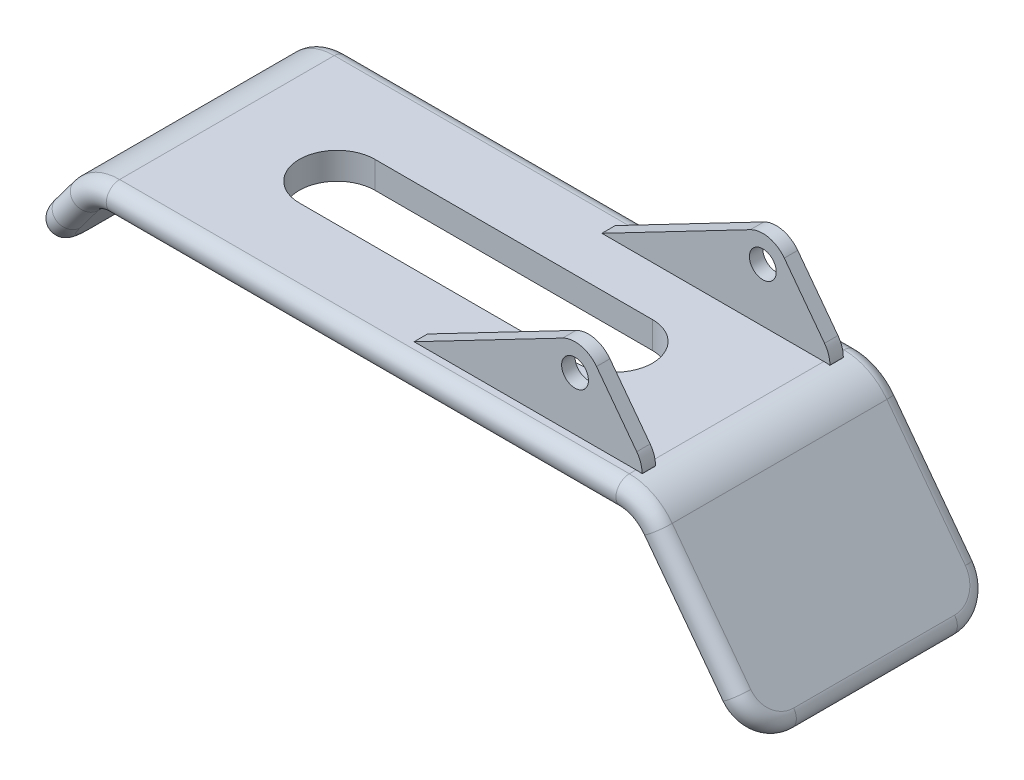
ISO-10303-21;
HEADER;
FILE_DESCRIPTION(('STEP AP214'),'2;1');
FILE_NAME('part.step','',(''),(''),'','','');
FILE_SCHEMA(('AUTOMOTIVE_DESIGN { 1 0 10303 214 1 1 1 1 }'));
ENDSEC;
DATA;
#1=APPLICATION_CONTEXT('core data for automotive mechanical design processes');
#2=APPLICATION_PROTOCOL_DEFINITION('international standard','automotive_design',2000,#1);
#3=PRODUCT_CONTEXT('',#1,'mechanical');
#4=PRODUCT('Part','Part','',(#3));
#5=PRODUCT_RELATED_PRODUCT_CATEGORY('part','',(#4));
#6=PRODUCT_DEFINITION_FORMATION('','',#4);
#7=PRODUCT_DEFINITION_CONTEXT('part definition',#1,'design');
#8=PRODUCT_DEFINITION('design','',#6,#7);
#9=PRODUCT_DEFINITION_SHAPE('','',#8);
#10=(LENGTH_UNIT() NAMED_UNIT(*) SI_UNIT(.MILLI.,.METRE.));
#11=(NAMED_UNIT(*) PLANE_ANGLE_UNIT() SI_UNIT($,.RADIAN.));
#12=(NAMED_UNIT(*) SI_UNIT($,.STERADIAN.) SOLID_ANGLE_UNIT());
#13=UNCERTAINTY_MEASURE_WITH_UNIT(LENGTH_MEASURE(1.E-05),#10,'distance_accuracy_value','');
#14=(GEOMETRIC_REPRESENTATION_CONTEXT(3) GLOBAL_UNCERTAINTY_ASSIGNED_CONTEXT((#13)) GLOBAL_UNIT_ASSIGNED_CONTEXT((#10,
#11,#12)) REPRESENTATION_CONTEXT('',''));
#15=CARTESIAN_POINT('',(0.,0.,0.));
#16=DIRECTION('',(0.,0.,1.));
#17=DIRECTION('',(1.,0.,0.));
#18=AXIS2_PLACEMENT_3D('',#15,#16,#17);
#19=CARTESIAN_POINT('',(19.,-2.,9.));
#20=DIRECTION('',(0.,0.,-1.));
#21=DIRECTION('',(-1.,0.,0.));
#22=AXIS2_PLACEMENT_3D('',#19,#20,#21);
#23=CYLINDRICAL_SURFACE('',#22,4.);
#24=CARTESIAN_POINT('',(19.,-2.,-6.5));
#25=DIRECTION('',(0.,0.,-1.));
#26=DIRECTION('',(1.,0.,0.));
#27=AXIS2_PLACEMENT_3D('',#24,#25,#26);
#28=CIRCLE('',#27,4.);
#29=CARTESIAN_POINT('',(19.,2.,-6.5));
#30=VERTEX_POINT('',#29);
#31=CARTESIAN_POINT('',(19.45,1.97460689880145,-6.5));
#32=VERTEX_POINT('',#31);
#33=EDGE_CURVE('E304',#30,#32,#28,.T.);
#34=ORIENTED_EDGE('',*,*,#33,.F.);
#35=DIRECTION('',(0.,0.,-1.));
#36=VECTOR('',#35,1.);
#37=CARTESIAN_POINT('',(19.,2.,9.));
#38=LINE('',#37,#36);
#39=CARTESIAN_POINT('',(19.,2.,6.5));
#40=VERTEX_POINT('',#39);
#41=EDGE_CURVE('E408',#40,#30,#38,.T.);
#42=ORIENTED_EDGE('',*,*,#41,.F.);
#43=CARTESIAN_POINT('',(19.,-2.,6.5));
#44=DIRECTION('',(0.,0.,-1.));
#45=DIRECTION('',(1.,0.,0.));
#46=AXIS2_PLACEMENT_3D('',#43,#44,#45);
#47=CIRCLE('',#46,4.);
#48=CARTESIAN_POINT('',(19.45,1.97460689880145,6.5));
#49=VERTEX_POINT('',#48);
#50=EDGE_CURVE('E347',#40,#49,#47,.T.);
#51=ORIENTED_EDGE('',*,*,#50,.T.);
#52=DIRECTION('',(0.,0.,1.));
#53=VECTOR('',#52,1.);
#54=CARTESIAN_POINT('',(19.45,1.97460689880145,6.5));
#55=LINE('',#54,#53);
#56=CARTESIAN_POINT('',(19.45,1.97460689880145,7.5));
#57=VERTEX_POINT('',#56);
#58=EDGE_CURVE('E366',#49,#57,#55,.T.);
#59=ORIENTED_EDGE('',*,*,#58,.T.);
#60=CARTESIAN_POINT('',(19.,-2.,7.5));
#61=DIRECTION('',(0.,0.,-1.));
#62=DIRECTION('',(1.,0.,0.));
#63=AXIS2_PLACEMENT_3D('',#60,#61,#62);
#64=CIRCLE('',#63,4.);
#65=CARTESIAN_POINT('',(19.,2.,7.5));
#66=VERTEX_POINT('',#65);
#67=EDGE_CURVE('E368',#66,#57,#64,.T.);
#68=ORIENTED_EDGE('',*,*,#67,.F.);
#69=CARTESIAN_POINT('',(19.,2.,8.));
#70=VERTEX_POINT('',#69);
#71=EDGE_CURVE('E404',#70,#66,#38,.T.);
#72=ORIENTED_EDGE('',*,*,#71,.F.);
#73=CARTESIAN_POINT('',(19.,-2.,8.));
#74=DIRECTION('',(0.,0.,1.));
#75=DIRECTION('',(1.,0.,0.));
#76=AXIS2_PLACEMENT_3D('',#73,#74,#75);
#77=CIRCLE('',#76,4.);
#78=CARTESIAN_POINT('',(22.2,0.400000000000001,8.));
#79=VERTEX_POINT('',#78);
#80=EDGE_CURVE('E426',#70,#79,#77,.F.);
#81=ORIENTED_EDGE('',*,*,#80,.T.);
#82=DIRECTION('',(0.,0.,-1.));
#83=VECTOR('',#82,1.);
#84=CARTESIAN_POINT('',(22.2,0.400000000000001,9.));
#85=LINE('',#84,#83);
#86=CARTESIAN_POINT('',(22.2,0.400000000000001,-8.));
#87=VERTEX_POINT('',#86);
#88=EDGE_CURVE('E407',#79,#87,#85,.T.);
#89=ORIENTED_EDGE('',*,*,#88,.T.);
#90=CARTESIAN_POINT('',(19.,-2.,-8.));
#91=DIRECTION('',(0.,0.,-1.));
#92=DIRECTION('',(-1.,0.,0.));
#93=AXIS2_PLACEMENT_3D('',#90,#91,#92);
#94=CIRCLE('',#93,4.);
#95=CARTESIAN_POINT('',(19.,2.,-8.));
#96=VERTEX_POINT('',#95);
#97=EDGE_CURVE('E423',#87,#96,#94,.F.);
#98=ORIENTED_EDGE('',*,*,#97,.T.);
#99=CARTESIAN_POINT('',(19.,2.,-7.5));
#100=VERTEX_POINT('',#99);
#101=EDGE_CURVE('E403',#100,#96,#38,.T.);
#102=ORIENTED_EDGE('',*,*,#101,.F.);
#103=CARTESIAN_POINT('',(19.,-2.,-7.5));
#104=DIRECTION('',(0.,0.,-1.));
#105=DIRECTION('',(1.,0.,0.));
#106=AXIS2_PLACEMENT_3D('',#103,#104,#105);
#107=CIRCLE('',#106,4.);
#108=CARTESIAN_POINT('',(19.45,1.97460689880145,-7.5));
#109=VERTEX_POINT('',#108);
#110=EDGE_CURVE('E293',#100,#109,#107,.T.);
#111=ORIENTED_EDGE('',*,*,#110,.T.);
#112=DIRECTION('',(0.,0.,-1.));
#113=VECTOR('',#112,1.);
#114=CARTESIAN_POINT('',(19.45,1.97460689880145,-6.5));
#115=LINE('',#114,#113);
#116=EDGE_CURVE('E321',#32,#109,#115,.T.);
#117=ORIENTED_EDGE('',*,*,#116,.F.);
#118=EDGE_LOOP('',(#34,#42,#51,#59,#68,#72,#81,#89,#98,#102,#111,#117));
#119=FACE_BOUND('',#118,.T.);
#120=ADVANCED_FACE('F34',(#119),#23,.T.);
#121=CARTESIAN_POINT('',(-19.,2.,9.));
#122=DIRECTION('',(0.,-1.,0.));
#123=DIRECTION('',(1.,0.,0.));
#124=AXIS2_PLACEMENT_3D('',#121,#122,#123);
#125=PLANE('',#124);
#126=DIRECTION('',(1.,0.,0.));
#127=VECTOR('',#126,1.);
#128=CARTESIAN_POINT('',(-10.785903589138,2.,2.81744789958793));
#129=LINE('',#128,#127);
#130=CARTESIAN_POINT('',(-10.785903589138,2.,2.81744789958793));
#131=VERTEX_POINT('',#130);
#132=CARTESIAN_POINT('',(9.90304434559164,2.,2.81744789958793));
#133=VERTEX_POINT('',#132);
#134=EDGE_CURVE('E266',#131,#133,#129,.T.);
#135=ORIENTED_EDGE('',*,*,#134,.F.);
#136=CARTESIAN_POINT('',(-10.785903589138,2.,0.));
#137=DIRECTION('',(0.,1.,0.));
#138=DIRECTION('',(-1.,0.,0.));
#139=AXIS2_PLACEMENT_3D('',#136,#137,#138);
#140=CIRCLE('',#139,2.81744789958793);
#141=CARTESIAN_POINT('',(-10.785903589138,2.,-2.81744789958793));
#142=VERTEX_POINT('',#141);
#143=EDGE_CURVE('E49',#142,#131,#140,.T.);
#144=ORIENTED_EDGE('',*,*,#143,.F.);
#145=DIRECTION('',(-1.,0.,0.));
#146=VECTOR('',#145,1.);
#147=CARTESIAN_POINT('',(-10.785903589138,2.,-2.81744789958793));
#148=LINE('',#147,#146);
#149=CARTESIAN_POINT('',(9.90304434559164,2.,-2.81744789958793));
#150=VERTEX_POINT('',#149);
#151=EDGE_CURVE('E273',#150,#142,#148,.T.);
#152=ORIENTED_EDGE('',*,*,#151,.F.);
#153=CARTESIAN_POINT('',(9.90304434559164,2.,0.));
#154=DIRECTION('',(0.,1.,0.));
#155=DIRECTION('',(-1.,0.,0.));
#156=AXIS2_PLACEMENT_3D('',#153,#154,#155);
#157=CIRCLE('',#156,2.81744789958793);
#158=EDGE_CURVE('E257',#133,#150,#157,.T.);
#159=ORIENTED_EDGE('',*,*,#158,.F.);
#160=EDGE_LOOP('',(#135,#144,#152,#159));
#161=FACE_BOUND('',#160,.T.);
#162=DIRECTION('',(1.,0.,0.));
#163=VECTOR('',#162,1.);
#164=CARTESIAN_POINT('',(2.45,2.,-6.5));
#165=LINE('',#164,#163);
#166=CARTESIAN_POINT('',(2.45,2.,-6.5));
#167=VERTEX_POINT('',#166);
#168=EDGE_CURVE('E289',#167,#30,#165,.T.);
#169=ORIENTED_EDGE('',*,*,#168,.F.);
#170=DIRECTION('',(0.,0.,-1.));
#171=VECTOR('',#170,1.);
#172=CARTESIAN_POINT('',(2.45,2.,-6.5));
#173=LINE('',#172,#171);
#174=CARTESIAN_POINT('',(2.45,2.,-7.5));
#175=VERTEX_POINT('',#174);
#176=EDGE_CURVE('E307',#167,#175,#173,.T.);
#177=ORIENTED_EDGE('',*,*,#176,.T.);
#178=DIRECTION('',(1.,0.,0.));
#179=VECTOR('',#178,1.);
#180=CARTESIAN_POINT('',(2.45,2.,-7.5));
#181=LINE('',#180,#179);
#182=EDGE_CURVE('E286',#175,#100,#181,.T.);
#183=ORIENTED_EDGE('',*,*,#182,.T.);
#184=ORIENTED_EDGE('',*,*,#101,.T.);
#185=DIRECTION('',(1.,0.,0.));
#186=VECTOR('',#185,1.);
#187=CARTESIAN_POINT('',(-19.,2.,-8.));
#188=LINE('',#187,#186);
#189=CARTESIAN_POINT('',(-19.,2.,-8.));
#190=VERTEX_POINT('',#189);
#191=EDGE_CURVE('E468',#96,#190,#188,.F.);
#192=ORIENTED_EDGE('',*,*,#191,.T.);
#193=DIRECTION('',(0.,0.,-1.));
#194=VECTOR('',#193,1.);
#195=CARTESIAN_POINT('',(-19.,2.,9.));
#196=LINE('',#195,#194);
#197=CARTESIAN_POINT('',(-19.,2.,8.));
#198=VERTEX_POINT('',#197);
#199=EDGE_CURVE('E400',#198,#190,#196,.T.);
#200=ORIENTED_EDGE('',*,*,#199,.F.);
#201=DIRECTION('',(1.,0.,0.));
#202=VECTOR('',#201,1.);
#203=CARTESIAN_POINT('',(-19.,2.,8.));
#204=LINE('',#203,#202);
#205=EDGE_CURVE('E465',#198,#70,#204,.T.);
#206=ORIENTED_EDGE('',*,*,#205,.T.);
#207=ORIENTED_EDGE('',*,*,#71,.T.);
#208=DIRECTION('',(1.,0.,0.));
#209=VECTOR('',#208,1.);
#210=CARTESIAN_POINT('',(2.45,2.,7.5));
#211=LINE('',#210,#209);
#212=CARTESIAN_POINT('',(2.45,2.,7.5));
#213=VERTEX_POINT('',#212);
#214=EDGE_CURVE('E341',#213,#66,#211,.T.);
#215=ORIENTED_EDGE('',*,*,#214,.F.);
#216=DIRECTION('',(0.,0.,1.));
#217=VECTOR('',#216,1.);
#218=CARTESIAN_POINT('',(2.45,2.,6.5));
#219=LINE('',#218,#217);
#220=CARTESIAN_POINT('',(2.45,2.,6.5));
#221=VERTEX_POINT('',#220);
#222=EDGE_CURVE('E384',#221,#213,#219,.T.);
#223=ORIENTED_EDGE('',*,*,#222,.F.);
#224=DIRECTION('',(1.,0.,0.));
#225=VECTOR('',#224,1.);
#226=CARTESIAN_POINT('',(2.45,2.,6.5));
#227=LINE('',#226,#225);
#228=EDGE_CURVE('E344',#221,#40,#227,.T.);
#229=ORIENTED_EDGE('',*,*,#228,.T.);
#230=ORIENTED_EDGE('',*,*,#41,.T.);
#231=EDGE_LOOP('',(#169,#177,#183,#184,#192,#200,#206,#207,#215,#223,#229,#230));
#232=FACE_BOUND('',#231,.T.);
#233=ADVANCED_FACE('F270',(#161,#232),#125,.F.);
#234=CARTESIAN_POINT('',(-19.,1.,8.));
#235=DIRECTION('',(-1.,0.,0.));
#236=DIRECTION('',(0.,-1.,0.));
#237=AXIS2_PLACEMENT_3D('',#234,#235,#236);
#238=CYLINDRICAL_SURFACE('',#237,1.);
#239=CARTESIAN_POINT('',(19.,1.,8.));
#240=DIRECTION('',(1.,0.,0.));
#241=DIRECTION('',(0.,0.,-1.));
#242=AXIS2_PLACEMENT_3D('',#239,#240,#241);
#243=CIRCLE('',#242,0.999999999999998);
#244=CARTESIAN_POINT('',(19.,0.,8.));
#245=VERTEX_POINT('',#244);
#246=EDGE_CURVE('E549',#70,#245,#243,.T.);
#247=ORIENTED_EDGE('',*,*,#246,.F.);
#248=ORIENTED_EDGE('',*,*,#205,.F.);
#249=CARTESIAN_POINT('',(-19.,1.,8.));
#250=DIRECTION('',(1.,0.,0.));
#251=DIRECTION('',(0.,0.,-1.));
#252=AXIS2_PLACEMENT_3D('',#249,#250,#251);
#253=CIRCLE('',#252,1.);
#254=CARTESIAN_POINT('',(-19.,0.,8.));
#255=VERTEX_POINT('',#254);
#256=EDGE_CURVE('E547',#198,#255,#253,.T.);
#257=ORIENTED_EDGE('',*,*,#256,.T.);
#258=DIRECTION('',(-1.,0.,0.));
#259=VECTOR('',#258,1.);
#260=CARTESIAN_POINT('',(-19.,0.,8.));
#261=LINE('',#260,#259);
#262=EDGE_CURVE('E471',#245,#255,#261,.T.);
#263=ORIENTED_EDGE('',*,*,#262,.F.);
#264=EDGE_LOOP('',(#247,#248,#257,#263));
#265=FACE_BOUND('',#264,.T.);
#266=ADVANCED_FACE('F36',(#265),#238,.T.);
#267=CARTESIAN_POINT('',(-19.,-2.,8.));
#268=DIRECTION('',(0.,0.,1.));
#269=DIRECTION('',(1.,0.,0.));
#270=AXIS2_PLACEMENT_3D('',#267,#268,#269);
#271=TOROIDAL_SURFACE('',#270,3.,1.);
#272=ORIENTED_EDGE('',*,*,#256,.F.);
#273=CARTESIAN_POINT('',(-19.,-2.,8.));
#274=DIRECTION('',(0.,0.,1.));
#275=DIRECTION('',(1.,0.,0.));
#276=AXIS2_PLACEMENT_3D('',#273,#274,#275);
#277=CIRCLE('',#276,4.);
#278=CARTESIAN_POINT('',(-22.2,0.399999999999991,8.));
#279=VERTEX_POINT('',#278);
#280=EDGE_CURVE('E477',#279,#198,#277,.F.);
#281=ORIENTED_EDGE('',*,*,#280,.F.);
#282=CARTESIAN_POINT('',(-21.4,-0.200000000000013,8.));
#283=DIRECTION('',(0.600000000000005,0.799999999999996,0.));
#284=DIRECTION('',(-0.799999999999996,0.600000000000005,0.));
#285=AXIS2_PLACEMENT_3D('',#282,#283,#284);
#286=CIRCLE('',#285,1.);
#287=CARTESIAN_POINT('',(-20.6,-0.800000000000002,8.));
#288=VERTEX_POINT('',#287);
#289=EDGE_CURVE('E545',#279,#288,#286,.T.);
#290=ORIENTED_EDGE('',*,*,#289,.T.);
#291=CARTESIAN_POINT('',(-19.,-2.,8.));
#292=DIRECTION('',(0.,0.,1.));
#293=DIRECTION('',(1.,0.,0.));
#294=AXIS2_PLACEMENT_3D('',#291,#292,#293);
#295=CIRCLE('',#294,2.);
#296=EDGE_CURVE('E483',#255,#288,#295,.T.);
#297=ORIENTED_EDGE('',*,*,#296,.F.);
#298=EDGE_LOOP('',(#272,#281,#290,#297));
#299=FACE_BOUND('',#298,.T.);
#300=ADVANCED_FACE('F664',(#299),#271,.T.);
#301=CARTESIAN_POINT('',(-22.75,-2.,8.));
#302=DIRECTION('',(-0.599999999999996,-0.800000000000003,0.));
#303=DIRECTION('',(0.800000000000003,-0.599999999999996,0.));
#304=AXIS2_PLACEMENT_3D('',#301,#302,#303);
#305=CYLINDRICAL_SURFACE('',#304,1.);
#306=ORIENTED_EDGE('',*,*,#289,.F.);
#307=DIRECTION('',(0.599999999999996,0.800000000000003,0.));
#308=VECTOR('',#307,1.);
#309=CARTESIAN_POINT('',(-23.55,-1.4,8.));
#310=LINE('',#309,#308);
#311=CARTESIAN_POINT('',(-23.55,-1.4,8.));
#312=VERTEX_POINT('',#311);
#313=EDGE_CURVE('E489',#312,#279,#310,.T.);
#314=ORIENTED_EDGE('',*,*,#313,.F.);
#315=CARTESIAN_POINT('',(-22.75,-2.,8.));
#316=DIRECTION('',(0.599999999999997,0.800000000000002,0.));
#317=DIRECTION('',(-0.800000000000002,0.599999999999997,0.));
#318=AXIS2_PLACEMENT_3D('',#315,#316,#317);
#319=CIRCLE('',#318,1.);
#320=CARTESIAN_POINT('',(-21.95,-2.59999999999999,8.));
#321=VERTEX_POINT('',#320);
#322=EDGE_CURVE('E543',#312,#321,#319,.T.);
#323=ORIENTED_EDGE('',*,*,#322,.T.);
#324=DIRECTION('',(-0.599999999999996,-0.800000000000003,0.));
#325=VECTOR('',#324,1.);
#326=CARTESIAN_POINT('',(-20.6,-0.800000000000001,8.));
#327=LINE('',#326,#325);
#328=EDGE_CURVE('E504',#288,#321,#327,.T.);
#329=ORIENTED_EDGE('',*,*,#328,.F.);
#330=EDGE_LOOP('',(#306,#314,#323,#329));
#331=FACE_BOUND('',#330,.T.);
#332=ADVANCED_FACE('F661',(#331),#305,.T.);
#333=CARTESIAN_POINT('',(-22.75,-2.,6.));
#334=DIRECTION('',(0.800000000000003,-0.599999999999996,0.));
#335=DIRECTION('',(0.599999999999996,0.800000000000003,0.));
#336=AXIS2_PLACEMENT_3D('',#333,#334,#335);
#337=TOROIDAL_SURFACE('',#336,2.,0.999999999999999);
#338=ORIENTED_EDGE('',*,*,#322,.F.);
#339=CARTESIAN_POINT('',(-23.55,-1.4,6.));
#340=DIRECTION('',(0.800000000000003,-0.599999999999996,0.));
#341=DIRECTION('',(0.599999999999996,0.800000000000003,0.));
#342=AXIS2_PLACEMENT_3D('',#339,#340,#341);
#343=CIRCLE('',#342,2.);
#344=CARTESIAN_POINT('',(-24.75,-3.00000000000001,6.));
#345=VERTEX_POINT('',#344);
#346=EDGE_CURVE('E492',#345,#312,#343,.F.);
#347=ORIENTED_EDGE('',*,*,#346,.F.);
#348=CARTESIAN_POINT('',(-23.95,-3.6,6.));
#349=DIRECTION('',(0.,0.,1.));
#350=DIRECTION('',(1.,0.,0.));
#351=AXIS2_PLACEMENT_3D('',#348,#349,#350);
#352=CIRCLE('',#351,0.999999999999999);
#353=CARTESIAN_POINT('',(-23.15,-4.2,6.));
#354=VERTEX_POINT('',#353);
#355=EDGE_CURVE('E541',#345,#354,#352,.T.);
#356=ORIENTED_EDGE('',*,*,#355,.T.);
#357=CARTESIAN_POINT('',(-21.95,-2.59999999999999,6.));
#358=DIRECTION('',(0.800000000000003,-0.599999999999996,0.));
#359=DIRECTION('',(0.599999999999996,0.800000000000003,0.));
#360=AXIS2_PLACEMENT_3D('',#357,#358,#359);
#361=CIRCLE('',#360,2.);
#362=EDGE_CURVE('E507',#321,#354,#361,.T.);
#363=ORIENTED_EDGE('',*,*,#362,.F.);
#364=EDGE_LOOP('',(#338,#347,#356,#363));
#365=FACE_BOUND('',#364,.T.);
#366=ADVANCED_FACE('F657',(#365),#337,.T.);
#367=CARTESIAN_POINT('',(-23.95,-3.6,-6.));
#368=DIRECTION('',(0.,0.,-1.));
#369=DIRECTION('',(-1.,0.,0.));
#370=AXIS2_PLACEMENT_3D('',#367,#368,#369);
#371=CYLINDRICAL_SURFACE('',#370,0.999999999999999);
#372=ORIENTED_EDGE('',*,*,#355,.F.);
#373=DIRECTION('',(0.,0.,1.));
#374=VECTOR('',#373,1.);
#375=CARTESIAN_POINT('',(-24.75,-3.,-6.));
#376=LINE('',#375,#374);
#377=CARTESIAN_POINT('',(-24.75,-3.00000000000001,-6.));
#378=VERTEX_POINT('',#377);
#379=EDGE_CURVE('E495',#378,#345,#376,.T.);
#380=ORIENTED_EDGE('',*,*,#379,.F.);
#381=CARTESIAN_POINT('',(-23.95,-3.6,-6.));
#382=DIRECTION('',(0.,0.,1.));
#383=DIRECTION('',(1.,0.,0.));
#384=AXIS2_PLACEMENT_3D('',#381,#382,#383);
#385=CIRCLE('',#384,0.999999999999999);
#386=CARTESIAN_POINT('',(-23.15,-4.2,-6.));
#387=VERTEX_POINT('',#386);
#388=EDGE_CURVE('E539',#378,#387,#385,.T.);
#389=ORIENTED_EDGE('',*,*,#388,.T.);
#390=DIRECTION('',(0.,0.,-1.));
#391=VECTOR('',#390,1.);
#392=CARTESIAN_POINT('',(-23.15,-4.2,9.));
#393=LINE('',#392,#391);
#394=EDGE_CURVE('E510',#354,#387,#393,.T.);
#395=ORIENTED_EDGE('',*,*,#394,.F.);
#396=EDGE_LOOP('',(#372,#380,#389,#395));
#397=FACE_BOUND('',#396,.T.);
#398=ADVANCED_FACE('F653',(#397),#371,.T.);
#399=CARTESIAN_POINT('',(-22.75,-1.99999999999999,-6.));
#400=DIRECTION('',(0.800000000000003,-0.599999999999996,0.));
#401=DIRECTION('',(0.599999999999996,0.800000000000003,0.));
#402=AXIS2_PLACEMENT_3D('',#399,#400,#401);
#403=TOROIDAL_SURFACE('',#402,2.,0.999999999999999);
#404=ORIENTED_EDGE('',*,*,#388,.F.);
#405=CARTESIAN_POINT('',(-23.55,-1.4,-6.));
#406=DIRECTION('',(0.800000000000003,-0.599999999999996,0.));
#407=DIRECTION('',(0.599999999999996,0.800000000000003,0.));
#408=AXIS2_PLACEMENT_3D('',#405,#406,#407);
#409=CIRCLE('',#408,2.);
#410=CARTESIAN_POINT('',(-23.55,-1.39999999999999,-8.));
#411=VERTEX_POINT('',#410);
#412=EDGE_CURVE('E498',#411,#378,#409,.F.);
#413=ORIENTED_EDGE('',*,*,#412,.F.);
#414=CARTESIAN_POINT('',(-22.75,-1.99999999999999,-8.));
#415=DIRECTION('',(-0.600000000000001,-0.799999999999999,0.));
#416=DIRECTION('',(0.799999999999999,-0.600000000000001,0.));
#417=AXIS2_PLACEMENT_3D('',#414,#415,#416);
#418=CIRCLE('',#417,0.999999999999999);
#419=CARTESIAN_POINT('',(-21.95,-2.6,-8.));
#420=VERTEX_POINT('',#419);
#421=EDGE_CURVE('E537',#411,#420,#418,.T.);
#422=ORIENTED_EDGE('',*,*,#421,.T.);
#423=CARTESIAN_POINT('',(-21.95,-2.59999999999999,-6.));
#424=DIRECTION('',(0.800000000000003,-0.599999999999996,0.));
#425=DIRECTION('',(0.599999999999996,0.800000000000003,0.));
#426=AXIS2_PLACEMENT_3D('',#423,#424,#425);
#427=CIRCLE('',#426,2.);
#428=EDGE_CURVE('E513',#387,#420,#427,.T.);
#429=ORIENTED_EDGE('',*,*,#428,.F.);
#430=EDGE_LOOP('',(#404,#413,#422,#429));
#431=FACE_BOUND('',#430,.T.);
#432=ADVANCED_FACE('F649',(#431),#403,.T.);
#433=CARTESIAN_POINT('',(-21.4,-0.200000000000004,-8.));
#434=DIRECTION('',(0.599999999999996,0.800000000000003,0.));
#435=DIRECTION('',(-0.800000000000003,0.599999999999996,0.));
#436=AXIS2_PLACEMENT_3D('',#433,#434,#435);
#437=CYLINDRICAL_SURFACE('',#436,1.);
#438=ORIENTED_EDGE('',*,*,#421,.F.);
#439=DIRECTION('',(0.599999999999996,0.800000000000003,0.));
#440=VECTOR('',#439,1.);
#441=CARTESIAN_POINT('',(-22.2,0.399999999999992,-8.));
#442=LINE('',#441,#440);
#443=CARTESIAN_POINT('',(-22.2,0.399999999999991,-8.));
#444=VERTEX_POINT('',#443);
#445=EDGE_CURVE('E501',#444,#411,#442,.F.);
#446=ORIENTED_EDGE('',*,*,#445,.F.);
#447=CARTESIAN_POINT('',(-21.4,-0.200000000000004,-8.));
#448=DIRECTION('',(-0.599999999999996,-0.800000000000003,0.));
#449=DIRECTION('',(0.800000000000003,-0.599999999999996,0.));
#450=AXIS2_PLACEMENT_3D('',#447,#448,#449);
#451=CIRCLE('',#450,1.);
#452=CARTESIAN_POINT('',(-20.6,-0.800000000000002,-8.));
#453=VERTEX_POINT('',#452);
#454=EDGE_CURVE('E535',#444,#453,#451,.T.);
#455=ORIENTED_EDGE('',*,*,#454,.T.);
#456=DIRECTION('',(-0.599999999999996,-0.800000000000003,0.));
#457=VECTOR('',#456,1.);
#458=CARTESIAN_POINT('',(-20.6,-0.8,-8.));
#459=LINE('',#458,#457);
#460=EDGE_CURVE('E516',#420,#453,#459,.F.);
#461=ORIENTED_EDGE('',*,*,#460,.F.);
#462=EDGE_LOOP('',(#438,#446,#455,#461));
#463=FACE_BOUND('',#462,.T.);
#464=ADVANCED_FACE('F645',(#463),#437,.T.);
#465=CARTESIAN_POINT('',(-19.,-2.,-8.));
#466=DIRECTION('',(0.,0.,-1.));
#467=DIRECTION('',(-1.,0.,0.));
#468=AXIS2_PLACEMENT_3D('',#465,#466,#467);
#469=TOROIDAL_SURFACE('',#468,3.,1.);
#470=ORIENTED_EDGE('',*,*,#454,.F.);
#471=CARTESIAN_POINT('',(-19.,-2.,-8.));
#472=DIRECTION('',(0.,0.,-1.));
#473=DIRECTION('',(-1.,0.,0.));
#474=AXIS2_PLACEMENT_3D('',#471,#472,#473);
#475=CIRCLE('',#474,4.);
#476=EDGE_CURVE('E480',#190,#444,#475,.F.);
#477=ORIENTED_EDGE('',*,*,#476,.F.);
#478=CARTESIAN_POINT('',(-19.,1.,-8.));
#479=DIRECTION('',(-1.,0.,0.));
#480=DIRECTION('',(0.,0.,1.));
#481=AXIS2_PLACEMENT_3D('',#478,#479,#480);
#482=CIRCLE('',#481,1.);
#483=CARTESIAN_POINT('',(-19.,0.,-8.));
#484=VERTEX_POINT('',#483);
#485=EDGE_CURVE('E533',#190,#484,#482,.T.);
#486=ORIENTED_EDGE('',*,*,#485,.T.);
#487=CARTESIAN_POINT('',(-19.,-2.,-8.));
#488=DIRECTION('',(0.,0.,-1.));
#489=DIRECTION('',(-1.,0.,0.));
#490=AXIS2_PLACEMENT_3D('',#487,#488,#489);
#491=CIRCLE('',#490,2.);
#492=EDGE_CURVE('E486',#453,#484,#491,.T.);
#493=ORIENTED_EDGE('',*,*,#492,.F.);
#494=EDGE_LOOP('',(#470,#477,#486,#493));
#495=FACE_BOUND('',#494,.T.);
#496=ADVANCED_FACE('F641',(#495),#469,.T.);
#497=CARTESIAN_POINT('',(19.,1.,-8.));
#498=DIRECTION('',(1.,0.,0.));
#499=DIRECTION('',(0.,1.,0.));
#500=AXIS2_PLACEMENT_3D('',#497,#498,#499);
#501=CYLINDRICAL_SURFACE('',#500,1.);
#502=ORIENTED_EDGE('',*,*,#485,.F.);
#503=ORIENTED_EDGE('',*,*,#191,.F.);
#504=CARTESIAN_POINT('',(19.,1.00000000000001,-8.));
#505=DIRECTION('',(-1.,0.,0.));
#506=DIRECTION('',(0.,0.,1.));
#507=AXIS2_PLACEMENT_3D('',#504,#505,#506);
#508=CIRCLE('',#507,0.999999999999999);
#509=CARTESIAN_POINT('',(19.,0.,-8.));
#510=VERTEX_POINT('',#509);
#511=EDGE_CURVE('E531',#96,#510,#508,.T.);
#512=ORIENTED_EDGE('',*,*,#511,.T.);
#513=DIRECTION('',(-1.,0.,0.));
#514=VECTOR('',#513,1.);
#515=CARTESIAN_POINT('',(19.,0.,-8.));
#516=LINE('',#515,#514);
#517=EDGE_CURVE('E474',#484,#510,#516,.F.);
#518=ORIENTED_EDGE('',*,*,#517,.F.);
#519=EDGE_LOOP('',(#502,#503,#512,#518));
#520=FACE_BOUND('',#519,.T.);
#521=ADVANCED_FACE('F637',(#520),#501,.T.);
#522=CARTESIAN_POINT('',(19.,-2.,-8.));
#523=DIRECTION('',(0.,0.,-1.));
#524=DIRECTION('',(-1.,0.,0.));
#525=AXIS2_PLACEMENT_3D('',#522,#523,#524);
#526=TOROIDAL_SURFACE('',#525,3.,1.);
#527=ORIENTED_EDGE('',*,*,#511,.F.);
#528=ORIENTED_EDGE('',*,*,#97,.F.);
#529=CARTESIAN_POINT('',(21.4,-0.199999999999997,-8.));
#530=DIRECTION('',(-0.599999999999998,0.800000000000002,0.));
#531=DIRECTION('',(-0.800000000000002,-0.599999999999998,0.));
#532=AXIS2_PLACEMENT_3D('',#529,#530,#531);
#533=CIRCLE('',#532,0.999999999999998);
#534=CARTESIAN_POINT('',(20.6,-0.799999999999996,-8.));
#535=VERTEX_POINT('',#534);
#536=EDGE_CURVE('E529',#87,#535,#533,.T.);
#537=ORIENTED_EDGE('',*,*,#536,.T.);
#538=CARTESIAN_POINT('',(19.,-2.,-8.));
#539=DIRECTION('',(0.,0.,-1.));
#540=DIRECTION('',(-1.,0.,0.));
#541=AXIS2_PLACEMENT_3D('',#538,#539,#540);
#542=CIRCLE('',#541,2.);
#543=EDGE_CURVE('E429',#510,#535,#542,.T.);
#544=ORIENTED_EDGE('',*,*,#543,.F.);
#545=EDGE_LOOP('',(#527,#528,#537,#544));
#546=FACE_BOUND('',#545,.T.);
#547=ADVANCED_FACE('F633',(#546),#526,.T.);
#548=CARTESIAN_POINT('',(27.25,-8.,-8.));
#549=DIRECTION('',(0.599999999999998,-0.800000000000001,0.));
#550=DIRECTION('',(0.800000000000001,0.599999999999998,0.));
#551=AXIS2_PLACEMENT_3D('',#548,#549,#550);
#552=CYLINDRICAL_SURFACE('',#551,1.);
#553=ORIENTED_EDGE('',*,*,#536,.F.);
#554=DIRECTION('',(0.599999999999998,-0.800000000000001,0.));
#555=VECTOR('',#554,1.);
#556=CARTESIAN_POINT('',(22.2,0.400000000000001,-8.));
#557=LINE('',#556,#555);
#558=CARTESIAN_POINT('',(28.05,-7.4,-8.));
#559=VERTEX_POINT('',#558);
#560=EDGE_CURVE('E435',#559,#87,#557,.F.);
#561=ORIENTED_EDGE('',*,*,#560,.F.);
#562=CARTESIAN_POINT('',(27.25,-8.,-8.));
#563=DIRECTION('',(-0.599999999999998,0.800000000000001,0.));
#564=DIRECTION('',(-0.800000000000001,-0.599999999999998,0.));
#565=AXIS2_PLACEMENT_3D('',#562,#563,#564);
#566=CIRCLE('',#565,1.);
#567=CARTESIAN_POINT('',(26.45,-8.6,-8.));
#568=VERTEX_POINT('',#567);
#569=EDGE_CURVE('E527',#559,#568,#566,.T.);
#570=ORIENTED_EDGE('',*,*,#569,.T.);
#571=DIRECTION('',(-0.599999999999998,0.800000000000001,0.));
#572=VECTOR('',#571,1.);
#573=CARTESIAN_POINT('',(26.45,-8.6,-8.));
#574=LINE('',#573,#572);
#575=EDGE_CURVE('E450',#535,#568,#574,.F.);
#576=ORIENTED_EDGE('',*,*,#575,.F.);
#577=EDGE_LOOP('',(#553,#561,#570,#576));
#578=FACE_BOUND('',#577,.T.);
#579=ADVANCED_FACE('F629',(#578),#552,.T.);
#580=CARTESIAN_POINT('',(27.25,-8.,-6.));
#581=DIRECTION('',(-0.800000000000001,-0.599999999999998,0.));
#582=DIRECTION('',(0.599999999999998,-0.800000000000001,0.));
#583=AXIS2_PLACEMENT_3D('',#580,#581,#582);
#584=TOROIDAL_SURFACE('',#583,2.,1.);
#585=ORIENTED_EDGE('',*,*,#569,.F.);
#586=CARTESIAN_POINT('',(28.05,-7.4,-6.));
#587=DIRECTION('',(-0.800000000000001,-0.599999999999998,0.));
#588=DIRECTION('',(0.599999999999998,-0.800000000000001,0.));
#589=AXIS2_PLACEMENT_3D('',#586,#587,#588);
#590=CIRCLE('',#589,2.);
#591=CARTESIAN_POINT('',(29.25,-9.,-6.));
#592=VERTEX_POINT('',#591);
#593=EDGE_CURVE('E438',#592,#559,#590,.F.);
#594=ORIENTED_EDGE('',*,*,#593,.F.);
#595=CARTESIAN_POINT('',(28.45,-9.6,-6.));
#596=DIRECTION('',(0.,0.,-1.));
#597=DIRECTION('',(-1.,0.,0.));
#598=AXIS2_PLACEMENT_3D('',#595,#596,#597);
#599=CIRCLE('',#598,1.);
#600=CARTESIAN_POINT('',(27.65,-10.2,-6.));
#601=VERTEX_POINT('',#600);
#602=EDGE_CURVE('E525',#592,#601,#599,.T.);
#603=ORIENTED_EDGE('',*,*,#602,.T.);
#604=CARTESIAN_POINT('',(26.45,-8.6,-6.));
#605=DIRECTION('',(-0.800000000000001,-0.599999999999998,0.));
#606=DIRECTION('',(0.599999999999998,-0.800000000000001,0.));
#607=AXIS2_PLACEMENT_3D('',#604,#605,#606);
#608=CIRCLE('',#607,2.);
#609=EDGE_CURVE('E453',#568,#601,#608,.T.);
#610=ORIENTED_EDGE('',*,*,#609,.F.);
#611=EDGE_LOOP('',(#585,#594,#603,#610));
#612=FACE_BOUND('',#611,.T.);
#613=ADVANCED_FACE('F625',(#612),#584,.T.);
#614=CARTESIAN_POINT('',(28.45,-9.6,6.));
#615=DIRECTION('',(0.,0.,1.));
#616=DIRECTION('',(1.,0.,0.));
#617=AXIS2_PLACEMENT_3D('',#614,#615,#616);
#618=CYLINDRICAL_SURFACE('',#617,1.);
#619=ORIENTED_EDGE('',*,*,#602,.F.);
#620=DIRECTION('',(0.,0.,-1.));
#621=VECTOR('',#620,1.);
#622=CARTESIAN_POINT('',(29.25,-9.,6.));
#623=LINE('',#622,#621);
#624=CARTESIAN_POINT('',(29.25,-9.,6.));
#625=VERTEX_POINT('',#624);
#626=EDGE_CURVE('E441',#625,#592,#623,.T.);
#627=ORIENTED_EDGE('',*,*,#626,.F.);
#628=CARTESIAN_POINT('',(28.45,-9.6,6.));
#629=DIRECTION('',(0.,0.,-1.));
#630=DIRECTION('',(-1.,0.,0.));
#631=AXIS2_PLACEMENT_3D('',#628,#629,#630);
#632=CIRCLE('',#631,1.);
#633=CARTESIAN_POINT('',(27.65,-10.2,6.));
#634=VERTEX_POINT('',#633);
#635=EDGE_CURVE('E523',#625,#634,#632,.T.);
#636=ORIENTED_EDGE('',*,*,#635,.T.);
#637=DIRECTION('',(0.,0.,1.));
#638=VECTOR('',#637,1.);
#639=CARTESIAN_POINT('',(27.65,-10.2,9.));
#640=LINE('',#639,#638);
#641=EDGE_CURVE('E456',#601,#634,#640,.T.);
#642=ORIENTED_EDGE('',*,*,#641,.F.);
#643=EDGE_LOOP('',(#619,#627,#636,#642));
#644=FACE_BOUND('',#643,.T.);
#645=ADVANCED_FACE('F621',(#644),#618,.T.);
#646=CARTESIAN_POINT('',(27.25,-8.,6.));
#647=DIRECTION('',(-0.800000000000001,-0.599999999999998,0.));
#648=DIRECTION('',(0.599999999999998,-0.800000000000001,0.));
#649=AXIS2_PLACEMENT_3D('',#646,#647,#648);
#650=TOROIDAL_SURFACE('',#649,2.,1.);
#651=ORIENTED_EDGE('',*,*,#635,.F.);
#652=CARTESIAN_POINT('',(28.05,-7.4,6.));
#653=DIRECTION('',(-0.800000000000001,-0.599999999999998,0.));
#654=DIRECTION('',(0.599999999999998,-0.800000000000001,0.));
#655=AXIS2_PLACEMENT_3D('',#652,#653,#654);
#656=CIRCLE('',#655,2.);
#657=CARTESIAN_POINT('',(28.05,-7.4,7.99999999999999));
#658=VERTEX_POINT('',#657);
#659=EDGE_CURVE('E444',#658,#625,#656,.F.);
#660=ORIENTED_EDGE('',*,*,#659,.F.);
#661=CARTESIAN_POINT('',(27.25,-8.,8.));
#662=DIRECTION('',(0.600000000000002,-0.799999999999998,0.));
#663=DIRECTION('',(0.799999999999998,0.600000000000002,0.));
#664=AXIS2_PLACEMENT_3D('',#661,#662,#663);
#665=CIRCLE('',#664,0.999999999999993);
#666=CARTESIAN_POINT('',(26.45,-8.59999999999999,8.00000000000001));
#667=VERTEX_POINT('',#666);
#668=EDGE_CURVE('E521',#658,#667,#665,.T.);
#669=ORIENTED_EDGE('',*,*,#668,.T.);
#670=CARTESIAN_POINT('',(26.45,-8.6,6.));
#671=DIRECTION('',(-0.800000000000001,-0.599999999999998,0.));
#672=DIRECTION('',(0.599999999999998,-0.800000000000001,0.));
#673=AXIS2_PLACEMENT_3D('',#670,#671,#672);
#674=CIRCLE('',#673,2.);
#675=EDGE_CURVE('E459',#634,#667,#674,.T.);
#676=ORIENTED_EDGE('',*,*,#675,.F.);
#677=EDGE_LOOP('',(#651,#660,#669,#676));
#678=FACE_BOUND('',#677,.T.);
#679=ADVANCED_FACE('F617',(#678),#650,.T.);
#680=CARTESIAN_POINT('',(21.4,-0.199999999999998,8.));
#681=DIRECTION('',(-0.599999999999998,0.800000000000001,0.));
#682=DIRECTION('',(-0.800000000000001,-0.599999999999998,0.));
#683=AXIS2_PLACEMENT_3D('',#680,#681,#682);
#684=CYLINDRICAL_SURFACE('',#683,0.999999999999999);
#685=ORIENTED_EDGE('',*,*,#668,.F.);
#686=DIRECTION('',(0.599999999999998,-0.800000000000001,0.));
#687=VECTOR('',#686,1.);
#688=CARTESIAN_POINT('',(22.2,0.400000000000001,8.));
#689=LINE('',#688,#687);
#690=EDGE_CURVE('E447',#79,#658,#689,.T.);
#691=ORIENTED_EDGE('',*,*,#690,.F.);
#692=CARTESIAN_POINT('',(21.4,-0.199999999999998,8.));
#693=DIRECTION('',(0.599999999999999,-0.800000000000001,0.));
#694=DIRECTION('',(0.800000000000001,0.599999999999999,0.));
#695=AXIS2_PLACEMENT_3D('',#692,#693,#694);
#696=CIRCLE('',#695,0.999999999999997);
#697=CARTESIAN_POINT('',(20.6,-0.799999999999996,8.));
#698=VERTEX_POINT('',#697);
#699=EDGE_CURVE('E519',#79,#698,#696,.T.);
#700=ORIENTED_EDGE('',*,*,#699,.T.);
#701=DIRECTION('',(-0.599999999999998,0.800000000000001,0.));
#702=VECTOR('',#701,1.);
#703=CARTESIAN_POINT('',(20.6,-0.799999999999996,8.));
#704=LINE('',#703,#702);
#705=EDGE_CURVE('E462',#667,#698,#704,.T.);
#706=ORIENTED_EDGE('',*,*,#705,.F.);
#707=EDGE_LOOP('',(#685,#691,#700,#706));
#708=FACE_BOUND('',#707,.T.);
#709=ADVANCED_FACE('F613',(#708),#684,.T.);
#710=CARTESIAN_POINT('',(19.,-2.,8.));
#711=DIRECTION('',(0.,0.,1.));
#712=DIRECTION('',(1.,0.,0.));
#713=AXIS2_PLACEMENT_3D('',#710,#711,#712);
#714=TOROIDAL_SURFACE('',#713,3.,0.999999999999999);
#715=ORIENTED_EDGE('',*,*,#80,.F.);
#716=ORIENTED_EDGE('',*,*,#246,.T.);
#717=CARTESIAN_POINT('',(19.,-2.,8.));
#718=DIRECTION('',(0.,0.,1.));
#719=DIRECTION('',(1.,0.,0.));
#720=AXIS2_PLACEMENT_3D('',#717,#718,#719);
#721=CIRCLE('',#720,2.);
#722=EDGE_CURVE('E432',#698,#245,#721,.T.);
#723=ORIENTED_EDGE('',*,*,#722,.F.);
#724=ORIENTED_EDGE('',*,*,#699,.F.);
#725=EDGE_LOOP('',(#715,#716,#723,#724));
#726=FACE_BOUND('',#725,.T.);
#727=ADVANCED_FACE('F609',(#726),#714,.T.);
#728=CARTESIAN_POINT('',(-22.2,0.399999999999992,9.));
#729=DIRECTION('',(0.800000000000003,-0.599999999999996,0.));
#730=DIRECTION('',(0.599999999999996,0.800000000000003,0.));
#731=AXIS2_PLACEMENT_3D('',#728,#729,#730);
#732=PLANE('',#731);
#733=DIRECTION('',(0.,0.,-1.));
#734=VECTOR('',#733,1.);
#735=CARTESIAN_POINT('',(-22.2,0.399999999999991,9.));
#736=LINE('',#735,#734);
#737=EDGE_CURVE('E387',#279,#444,#736,.T.);
#738=ORIENTED_EDGE('',*,*,#737,.T.);
#739=ORIENTED_EDGE('',*,*,#445,.T.);
#740=ORIENTED_EDGE('',*,*,#412,.T.);
#741=ORIENTED_EDGE('',*,*,#379,.T.);
#742=ORIENTED_EDGE('',*,*,#346,.T.);
#743=ORIENTED_EDGE('',*,*,#313,.T.);
#744=EDGE_LOOP('',(#738,#739,#740,#741,#742,#743));
#745=FACE_BOUND('',#744,.T.);
#746=ADVANCED_FACE('F605',(#745),#732,.F.);
#747=CARTESIAN_POINT('',(-20.6,-0.800000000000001,9.));
#748=DIRECTION('',(0.800000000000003,-0.599999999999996,0.));
#749=DIRECTION('',(0.599999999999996,0.800000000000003,0.));
#750=AXIS2_PLACEMENT_3D('',#747,#748,#749);
#751=PLANE('',#750);
#752=ORIENTED_EDGE('',*,*,#428,.T.);
#753=ORIENTED_EDGE('',*,*,#460,.T.);
#754=DIRECTION('',(0.,0.,-1.));
#755=VECTOR('',#754,1.);
#756=CARTESIAN_POINT('',(-20.6,-0.800000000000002,9.));
#757=LINE('',#756,#755);
#758=EDGE_CURVE('E420',#288,#453,#757,.T.);
#759=ORIENTED_EDGE('',*,*,#758,.F.);
#760=ORIENTED_EDGE('',*,*,#328,.T.);
#761=ORIENTED_EDGE('',*,*,#362,.T.);
#762=ORIENTED_EDGE('',*,*,#394,.T.);
#763=EDGE_LOOP('',(#752,#753,#759,#760,#761,#762));
#764=FACE_BOUND('',#763,.T.);
#765=ADVANCED_FACE('F601',(#764),#751,.T.);
#766=CARTESIAN_POINT('',(-19.,-2.,9.));
#767=DIRECTION('',(0.,0.,-1.));
#768=DIRECTION('',(-1.,0.,0.));
#769=AXIS2_PLACEMENT_3D('',#766,#767,#768);
#770=CYLINDRICAL_SURFACE('',#769,2.);
#771=ORIENTED_EDGE('',*,*,#758,.T.);
#772=ORIENTED_EDGE('',*,*,#492,.T.);
#773=DIRECTION('',(0.,0.,-1.));
#774=VECTOR('',#773,1.);
#775=CARTESIAN_POINT('',(-19.,0.,9.));
#776=LINE('',#775,#774);
#777=EDGE_CURVE('E417',#255,#484,#776,.T.);
#778=ORIENTED_EDGE('',*,*,#777,.F.);
#779=ORIENTED_EDGE('',*,*,#296,.T.);
#780=EDGE_LOOP('',(#771,#772,#778,#779));
#781=FACE_BOUND('',#780,.T.);
#782=ADVANCED_FACE('F598',(#781),#770,.F.);
#783=CARTESIAN_POINT('',(-19.,0.,9.));
#784=DIRECTION('',(0.,-1.,0.));
#785=DIRECTION('',(1.,0.,0.));
#786=AXIS2_PLACEMENT_3D('',#783,#784,#785);
#787=PLANE('',#786);
#788=CARTESIAN_POINT('',(-10.785903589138,0.,0.));
#789=DIRECTION('',(0.,-1.,0.));
#790=DIRECTION('',(1.,0.,0.));
#791=AXIS2_PLACEMENT_3D('',#788,#789,#790);
#792=CIRCLE('',#791,2.81744789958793);
#793=CARTESIAN_POINT('',(-10.785903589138,0.,2.81744789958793));
#794=VERTEX_POINT('',#793);
#795=CARTESIAN_POINT('',(-10.785903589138,0.,-2.81744789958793));
#796=VERTEX_POINT('',#795);
#797=EDGE_CURVE('E11',#794,#796,#792,.T.);
#798=ORIENTED_EDGE('',*,*,#797,.F.);
#799=DIRECTION('',(-1.,0.,0.));
#800=VECTOR('',#799,1.);
#801=CARTESIAN_POINT('',(-19.,0.,2.81744789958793));
#802=LINE('',#801,#800);
#803=CARTESIAN_POINT('',(9.90304434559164,0.,2.81744789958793));
#804=VERTEX_POINT('',#803);
#805=EDGE_CURVE('E551',#804,#794,#802,.T.);
#806=ORIENTED_EDGE('',*,*,#805,.F.);
#807=CARTESIAN_POINT('',(9.90304434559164,0.,0.));
#808=DIRECTION('',(0.,-1.,0.));
#809=DIRECTION('',(1.,0.,0.));
#810=AXIS2_PLACEMENT_3D('',#807,#808,#809);
#811=CIRCLE('',#810,2.81744789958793);
#812=CARTESIAN_POINT('',(9.90304434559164,0.,-2.81744789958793));
#813=VERTEX_POINT('',#812);
#814=EDGE_CURVE('E260',#813,#804,#811,.T.);
#815=ORIENTED_EDGE('',*,*,#814,.F.);
#816=DIRECTION('',(1.,0.,0.));
#817=VECTOR('',#816,1.);
#818=CARTESIAN_POINT('',(-19.,0.,-2.81744789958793));
#819=LINE('',#818,#817);
#820=EDGE_CURVE('E42',#796,#813,#819,.T.);
#821=ORIENTED_EDGE('',*,*,#820,.F.);
#822=EDGE_LOOP('',(#798,#806,#815,#821));
#823=FACE_BOUND('',#822,.T.);
#824=ORIENTED_EDGE('',*,*,#777,.T.);
#825=ORIENTED_EDGE('',*,*,#517,.T.);
#826=DIRECTION('',(0.,0.,-1.));
#827=VECTOR('',#826,1.);
#828=CARTESIAN_POINT('',(19.,0.,9.));
#829=LINE('',#828,#827);
#830=EDGE_CURVE('E414',#245,#510,#829,.T.);
#831=ORIENTED_EDGE('',*,*,#830,.F.);
#832=ORIENTED_EDGE('',*,*,#262,.T.);
#833=EDGE_LOOP('',(#824,#825,#831,#832));
#834=FACE_BOUND('',#833,.T.);
#835=ADVANCED_FACE('F559',(#823,#834),#787,.T.);
#836=CARTESIAN_POINT('',(19.,-2.,9.));
#837=DIRECTION('',(0.,0.,-1.));
#838=DIRECTION('',(-1.,0.,0.));
#839=AXIS2_PLACEMENT_3D('',#836,#837,#838);
#840=CYLINDRICAL_SURFACE('',#839,2.);
#841=DIRECTION('',(0.,0.,-1.));
#842=VECTOR('',#841,1.);
#843=CARTESIAN_POINT('',(20.6,-0.799999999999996,9.));
#844=LINE('',#843,#842);
#845=EDGE_CURVE('E411',#698,#535,#844,.T.);
#846=ORIENTED_EDGE('',*,*,#845,.F.);
#847=ORIENTED_EDGE('',*,*,#722,.T.);
#848=ORIENTED_EDGE('',*,*,#830,.T.);
#849=ORIENTED_EDGE('',*,*,#543,.T.);
#850=EDGE_LOOP('',(#846,#847,#848,#849));
#851=FACE_BOUND('',#850,.T.);
#852=ADVANCED_FACE('F591',(#851),#840,.F.);
#853=CARTESIAN_POINT('',(20.6,-0.799999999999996,9.));
#854=DIRECTION('',(-0.800000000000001,-0.599999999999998,0.));
#855=DIRECTION('',(0.599999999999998,-0.800000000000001,0.));
#856=AXIS2_PLACEMENT_3D('',#853,#854,#855);
#857=PLANE('',#856);
#858=ORIENTED_EDGE('',*,*,#675,.T.);
#859=ORIENTED_EDGE('',*,*,#705,.T.);
#860=ORIENTED_EDGE('',*,*,#845,.T.);
#861=ORIENTED_EDGE('',*,*,#575,.T.);
#862=ORIENTED_EDGE('',*,*,#609,.T.);
#863=ORIENTED_EDGE('',*,*,#641,.T.);
#864=EDGE_LOOP('',(#858,#859,#860,#861,#862,#863));
#865=FACE_BOUND('',#864,.T.);
#866=ADVANCED_FACE('F587',(#865),#857,.T.);
#867=CARTESIAN_POINT('',(22.2,0.400000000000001,9.));
#868=DIRECTION('',(-0.800000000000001,-0.599999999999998,0.));
#869=DIRECTION('',(0.599999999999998,-0.800000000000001,0.));
#870=AXIS2_PLACEMENT_3D('',#867,#868,#869);
#871=PLANE('',#870);
#872=ORIENTED_EDGE('',*,*,#88,.F.);
#873=ORIENTED_EDGE('',*,*,#690,.T.);
#874=ORIENTED_EDGE('',*,*,#659,.T.);
#875=ORIENTED_EDGE('',*,*,#626,.T.);
#876=ORIENTED_EDGE('',*,*,#593,.T.);
#877=ORIENTED_EDGE('',*,*,#560,.T.);
#878=EDGE_LOOP('',(#872,#873,#874,#875,#876,#877));
#879=FACE_BOUND('',#878,.T.);
#880=ADVANCED_FACE('F583',(#879),#871,.F.);
#881=CARTESIAN_POINT('',(-19.,-2.,9.));
#882=DIRECTION('',(0.,0.,-1.));
#883=DIRECTION('',(-1.,0.,0.));
#884=AXIS2_PLACEMENT_3D('',#881,#882,#883);
#885=CYLINDRICAL_SURFACE('',#884,4.);
#886=ORIENTED_EDGE('',*,*,#199,.T.);
#887=ORIENTED_EDGE('',*,*,#476,.T.);
#888=ORIENTED_EDGE('',*,*,#737,.F.);
#889=ORIENTED_EDGE('',*,*,#280,.T.);
#890=EDGE_LOOP('',(#886,#887,#888,#889));
#891=FACE_BOUND('',#890,.T.);
#892=ADVANCED_FACE('F586',(#891),#885,.T.);
#893=CARTESIAN_POINT('',(2.45,2.,6.5));
#894=DIRECTION('',(-0.46224989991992,0.88674969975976,0.));
#895=DIRECTION('',(-0.88674969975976,-0.46224989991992,0.));
#896=AXIS2_PLACEMENT_3D('',#893,#894,#895);
#897=PLANE('',#896);
#898=DIRECTION('',(-0.88674969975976,-0.46224989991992,0.));
#899=VECTOR('',#898,1.);
#900=CARTESIAN_POINT('',(2.45,2.,7.5));
#901=LINE('',#900,#899);
#902=CARTESIAN_POINT('',(13.5255002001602,7.77349939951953,7.5));
#903=VERTEX_POINT('',#902);
#904=EDGE_CURVE('E348',#903,#213,#901,.T.);
#905=ORIENTED_EDGE('',*,*,#904,.F.);
#906=DIRECTION('',(0.,0.,1.));
#907=VECTOR('',#906,1.);
#908=CARTESIAN_POINT('',(13.5255002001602,7.77349939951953,6.5));
#909=LINE('',#908,#907);
#910=CARTESIAN_POINT('',(13.5255002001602,7.77349939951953,6.5));
#911=VERTEX_POINT('',#910);
#912=EDGE_CURVE('E388',#911,#903,#909,.T.);
#913=ORIENTED_EDGE('',*,*,#912,.F.);
#914=DIRECTION('',(-0.88674969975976,-0.46224989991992,0.));
#915=VECTOR('',#914,1.);
#916=CARTESIAN_POINT('',(2.45,2.,6.5));
#917=LINE('',#916,#915);
#918=EDGE_CURVE('E363',#911,#221,#917,.T.);
#919=ORIENTED_EDGE('',*,*,#918,.T.);
#920=ORIENTED_EDGE('',*,*,#222,.T.);
#921=EDGE_LOOP('',(#905,#913,#919,#920));
#922=FACE_BOUND('',#921,.T.);
#923=ADVANCED_FACE('F716',(#922),#897,.T.);
#924=CARTESIAN_POINT('',(14.45,6.00000000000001,6.5));
#925=DIRECTION('',(0.,0.,1.));
#926=DIRECTION('',(1.,0.,0.));
#927=AXIS2_PLACEMENT_3D('',#924,#925,#926);
#928=CYLINDRICAL_SURFACE('',#927,2.);
#929=CARTESIAN_POINT('',(14.45,6.00000000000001,7.5));
#930=DIRECTION('',(0.,0.,1.));
#931=DIRECTION('',(-1.,0.,0.));
#932=AXIS2_PLACEMENT_3D('',#929,#930,#931);
#933=CIRCLE('',#932,2.);
#934=CARTESIAN_POINT('',(16.05,7.20000000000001,7.5));
#935=VERTEX_POINT('',#934);
#936=EDGE_CURVE('E380',#935,#903,#933,.T.);
#937=ORIENTED_EDGE('',*,*,#936,.F.);
#938=DIRECTION('',(0.,0.,1.));
#939=VECTOR('',#938,1.);
#940=CARTESIAN_POINT('',(16.05,7.20000000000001,6.5));
#941=LINE('',#940,#939);
#942=CARTESIAN_POINT('',(16.05,7.20000000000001,6.5));
#943=VERTEX_POINT('',#942);
#944=EDGE_CURVE('E390',#943,#935,#941,.T.);
#945=ORIENTED_EDGE('',*,*,#944,.F.);
#946=CARTESIAN_POINT('',(14.45,6.00000000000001,6.5));
#947=DIRECTION('',(0.,0.,1.));
#948=DIRECTION('',(-1.,0.,0.));
#949=AXIS2_PLACEMENT_3D('',#946,#947,#948);
#950=CIRCLE('',#949,2.);
#951=EDGE_CURVE('E360',#943,#911,#950,.T.);
#952=ORIENTED_EDGE('',*,*,#951,.T.);
#953=ORIENTED_EDGE('',*,*,#912,.T.);
#954=EDGE_LOOP('',(#937,#945,#952,#953));
#955=FACE_BOUND('',#954,.T.);
#956=ADVANCED_FACE('F788',(#955),#928,.T.);
#957=CARTESIAN_POINT('',(16.05,7.20000000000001,6.5));
#958=DIRECTION('',(0.800000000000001,0.599999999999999,0.));
#959=DIRECTION('',(-0.599999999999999,0.800000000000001,0.));
#960=AXIS2_PLACEMENT_3D('',#957,#958,#959);
#961=PLANE('',#960);
#962=DIRECTION('',(-0.599999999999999,0.800000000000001,0.));
#963=VECTOR('',#962,1.);
#964=CARTESIAN_POINT('',(16.05,7.20000000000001,7.5));
#965=LINE('',#964,#963);
#966=CARTESIAN_POINT('',(19.05,3.2,7.5));
#967=VERTEX_POINT('',#966);
#968=EDGE_CURVE('E377',#967,#935,#965,.T.);
#969=ORIENTED_EDGE('',*,*,#968,.F.);
#970=DIRECTION('',(0.,0.,1.));
#971=VECTOR('',#970,1.);
#972=CARTESIAN_POINT('',(19.05,3.2,6.5));
#973=LINE('',#972,#971);
#974=CARTESIAN_POINT('',(19.05,3.2,6.5));
#975=VERTEX_POINT('',#974);
#976=EDGE_CURVE('E392',#975,#967,#973,.T.);
#977=ORIENTED_EDGE('',*,*,#976,.F.);
#978=DIRECTION('',(-0.599999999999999,0.800000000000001,0.));
#979=VECTOR('',#978,1.);
#980=CARTESIAN_POINT('',(16.05,7.20000000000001,6.5));
#981=LINE('',#980,#979);
#982=EDGE_CURVE('E357',#975,#943,#981,.T.);
#983=ORIENTED_EDGE('',*,*,#982,.T.);
#984=ORIENTED_EDGE('',*,*,#944,.T.);
#985=EDGE_LOOP('',(#969,#977,#983,#984));
#986=FACE_BOUND('',#985,.T.);
#987=ADVANCED_FACE('F791',(#986),#961,.T.);
#988=CARTESIAN_POINT('',(17.45,2.,6.5));
#989=DIRECTION('',(0.,0.,1.));
#990=DIRECTION('',(1.,0.,0.));
#991=AXIS2_PLACEMENT_3D('',#988,#989,#990);
#992=CYLINDRICAL_SURFACE('',#991,2.);
#993=CARTESIAN_POINT('',(17.45,2.,7.5));
#994=DIRECTION('',(0.,0.,1.));
#995=DIRECTION('',(-1.,0.,0.));
#996=AXIS2_PLACEMENT_3D('',#993,#994,#995);
#997=CIRCLE('',#996,2.);
#998=CARTESIAN_POINT('',(19.45,2.,7.5));
#999=VERTEX_POINT('',#998);
#1000=EDGE_CURVE('E374',#999,#967,#997,.T.);
#1001=ORIENTED_EDGE('',*,*,#1000,.F.);
#1002=DIRECTION('',(0.,0.,1.));
#1003=VECTOR('',#1002,1.);
#1004=CARTESIAN_POINT('',(19.45,2.,6.5));
#1005=LINE('',#1004,#1003);
#1006=CARTESIAN_POINT('',(19.45,2.,6.5));
#1007=VERTEX_POINT('',#1006);
#1008=EDGE_CURVE('E394',#1007,#999,#1005,.T.);
#1009=ORIENTED_EDGE('',*,*,#1008,.F.);
#1010=CARTESIAN_POINT('',(17.45,2.,6.5));
#1011=DIRECTION('',(0.,0.,1.));
#1012=DIRECTION('',(-1.,0.,0.));
#1013=AXIS2_PLACEMENT_3D('',#1010,#1011,#1012);
#1014=CIRCLE('',#1013,2.);
#1015=EDGE_CURVE('E354',#1007,#975,#1014,.T.);
#1016=ORIENTED_EDGE('',*,*,#1015,.T.);
#1017=ORIENTED_EDGE('',*,*,#976,.T.);
#1018=EDGE_LOOP('',(#1001,#1009,#1016,#1017));
#1019=FACE_BOUND('',#1018,.T.);
#1020=ADVANCED_FACE('F795',(#1019),#992,.T.);
#1021=CARTESIAN_POINT('',(19.45,2.,6.5));
#1022=DIRECTION('',(1.,1.36629509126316E-13,0.));
#1023=DIRECTION('',(-1.36629509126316E-13,1.,0.));
#1024=AXIS2_PLACEMENT_3D('',#1021,#1022,#1023);
#1025=PLANE('',#1024);
#1026=DIRECTION('',(-1.36629509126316E-13,1.,0.));
#1027=VECTOR('',#1026,1.);
#1028=CARTESIAN_POINT('',(19.45,2.,7.5));
#1029=LINE('',#1028,#1027);
#1030=EDGE_CURVE('E371',#57,#999,#1029,.T.);
#1031=ORIENTED_EDGE('',*,*,#1030,.F.);
#1032=ORIENTED_EDGE('',*,*,#58,.F.);
#1033=DIRECTION('',(-1.36629509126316E-13,1.,0.));
#1034=VECTOR('',#1033,1.);
#1035=CARTESIAN_POINT('',(19.45,2.,6.5));
#1036=LINE('',#1035,#1034);
#1037=EDGE_CURVE('E351',#49,#1007,#1036,.T.);
#1038=ORIENTED_EDGE('',*,*,#1037,.T.);
#1039=ORIENTED_EDGE('',*,*,#1008,.T.);
#1040=EDGE_LOOP('',(#1031,#1032,#1038,#1039));
#1041=FACE_BOUND('',#1040,.T.);
#1042=ADVANCED_FACE('F781',(#1041),#1025,.T.);
#1043=CARTESIAN_POINT('',(19.,-2.,6.5));
#1044=DIRECTION('',(0.,0.,1.));
#1045=DIRECTION('',(1.,0.,0.));
#1046=AXIS2_PLACEMENT_3D('',#1043,#1044,#1045);
#1047=PLANE('',#1046);
#1048=CARTESIAN_POINT('',(14.45,6.00000000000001,6.5));
#1049=DIRECTION('',(0.,0.,1.));
#1050=DIRECTION('',(1.,0.,0.));
#1051=AXIS2_PLACEMENT_3D('',#1048,#1049,#1050);
#1052=CIRCLE('',#1051,1.);
#1053=CARTESIAN_POINT('',(15.45,6.00000000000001,6.5));
#1054=VERTEX_POINT('',#1053);
#1055=EDGE_CURVE('E338',#1054,#1054,#1052,.T.);
#1056=ORIENTED_EDGE('',*,*,#1055,.T.);
#1057=EDGE_LOOP('',(#1056));
#1058=FACE_BOUND('',#1057,.T.);
#1059=ORIENTED_EDGE('',*,*,#228,.F.);
#1060=ORIENTED_EDGE('',*,*,#918,.F.);
#1061=ORIENTED_EDGE('',*,*,#951,.F.);
#1062=ORIENTED_EDGE('',*,*,#982,.F.);
#1063=ORIENTED_EDGE('',*,*,#1015,.F.);
#1064=ORIENTED_EDGE('',*,*,#1037,.F.);
#1065=ORIENTED_EDGE('',*,*,#50,.F.);
#1066=EDGE_LOOP('',(#1059,#1060,#1061,#1062,#1063,#1064,#1065));
#1067=FACE_BOUND('',#1066,.T.);
#1068=ADVANCED_FACE('F720',(#1058,#1067),#1047,.F.);
#1069=CARTESIAN_POINT('',(19.,-2.,7.5));
#1070=DIRECTION('',(0.,0.,1.));
#1071=DIRECTION('',(1.,0.,0.));
#1072=AXIS2_PLACEMENT_3D('',#1069,#1070,#1071);
#1073=PLANE('',#1072);
#1074=CARTESIAN_POINT('',(14.45,6.00000000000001,7.5));
#1075=DIRECTION('',(0.,0.,1.));
#1076=DIRECTION('',(1.,0.,0.));
#1077=AXIS2_PLACEMENT_3D('',#1074,#1075,#1076);
#1078=CIRCLE('',#1077,1.);
#1079=CARTESIAN_POINT('',(15.45,6.00000000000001,7.5));
#1080=VERTEX_POINT('',#1079);
#1081=EDGE_CURVE('E324',#1080,#1080,#1078,.T.);
#1082=ORIENTED_EDGE('',*,*,#1081,.F.);
#1083=EDGE_LOOP('',(#1082));
#1084=FACE_BOUND('',#1083,.T.);
#1085=ORIENTED_EDGE('',*,*,#214,.T.);
#1086=ORIENTED_EDGE('',*,*,#67,.T.);
#1087=ORIENTED_EDGE('',*,*,#1030,.T.);
#1088=ORIENTED_EDGE('',*,*,#1000,.T.);
#1089=ORIENTED_EDGE('',*,*,#968,.T.);
#1090=ORIENTED_EDGE('',*,*,#936,.T.);
#1091=ORIENTED_EDGE('',*,*,#904,.T.);
#1092=EDGE_LOOP('',(#1085,#1086,#1087,#1088,#1089,#1090,#1091));
#1093=FACE_BOUND('',#1092,.T.);
#1094=ADVANCED_FACE('F712',(#1084,#1093),#1073,.T.);
#1095=CARTESIAN_POINT('',(14.45,6.00000000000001,6.5));
#1096=DIRECTION('',(0.,0.,1.));
#1097=DIRECTION('',(1.,0.,0.));
#1098=AXIS2_PLACEMENT_3D('',#1095,#1096,#1097);
#1099=CYLINDRICAL_SURFACE('',#1098,1.);
#1100=ORIENTED_EDGE('',*,*,#1055,.F.);
#1101=EDGE_LOOP('',(#1100));
#1102=FACE_BOUND('',#1101,.T.);
#1103=ORIENTED_EDGE('',*,*,#1081,.T.);
#1104=EDGE_LOOP('',(#1103));
#1105=FACE_BOUND('',#1104,.T.);
#1106=ADVANCED_FACE('F765',(#1102,#1105),#1099,.F.);
#1107=CARTESIAN_POINT('',(19.,-2.,-6.5));
#1108=DIRECTION('',(0.,0.,-1.));
#1109=DIRECTION('',(1.,0.,0.));
#1110=AXIS2_PLACEMENT_3D('',#1107,#1108,#1109);
#1111=PLANE('',#1110);
#1112=ORIENTED_EDGE('',*,*,#168,.T.);
#1113=ORIENTED_EDGE('',*,*,#33,.T.);
#1114=DIRECTION('',(-1.36629509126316E-13,1.,0.));
#1115=VECTOR('',#1114,1.);
#1116=CARTESIAN_POINT('',(19.45,2.,-6.5));
#1117=LINE('',#1116,#1115);
#1118=CARTESIAN_POINT('',(19.45,2.,-6.5));
#1119=VERTEX_POINT('',#1118);
#1120=EDGE_CURVE('E302',#32,#1119,#1117,.T.);
#1121=ORIENTED_EDGE('',*,*,#1120,.T.);
#1122=CARTESIAN_POINT('',(17.45,2.,-6.5));
#1123=DIRECTION('',(0.,0.,1.));
#1124=DIRECTION('',(-1.,0.,0.));
#1125=AXIS2_PLACEMENT_3D('',#1122,#1123,#1124);
#1126=CIRCLE('',#1125,2.);
#1127=CARTESIAN_POINT('',(19.05,3.2,-6.5));
#1128=VERTEX_POINT('',#1127);
#1129=EDGE_CURVE('E300',#1119,#1128,#1126,.T.);
#1130=ORIENTED_EDGE('',*,*,#1129,.T.);
#1131=DIRECTION('',(-0.599999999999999,0.800000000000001,0.));
#1132=VECTOR('',#1131,1.);
#1133=CARTESIAN_POINT('',(16.05,7.20000000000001,-6.5));
#1134=LINE('',#1133,#1132);
#1135=CARTESIAN_POINT('',(16.05,7.20000000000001,-6.5));
#1136=VERTEX_POINT('',#1135);
#1137=EDGE_CURVE('E298',#1128,#1136,#1134,.T.);
#1138=ORIENTED_EDGE('',*,*,#1137,.T.);
#1139=CARTESIAN_POINT('',(14.45,6.00000000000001,-6.5));
#1140=DIRECTION('',(0.,0.,1.));
#1141=DIRECTION('',(-1.,0.,0.));
#1142=AXIS2_PLACEMENT_3D('',#1139,#1140,#1141);
#1143=CIRCLE('',#1142,2.);
#1144=CARTESIAN_POINT('',(13.5255002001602,7.77349939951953,-6.5));
#1145=VERTEX_POINT('',#1144);
#1146=EDGE_CURVE('E296',#1136,#1145,#1143,.T.);
#1147=ORIENTED_EDGE('',*,*,#1146,.T.);
#1148=DIRECTION('',(-0.88674969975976,-0.46224989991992,0.));
#1149=VECTOR('',#1148,1.);
#1150=CARTESIAN_POINT('',(2.45,2.,-6.5));
#1151=LINE('',#1150,#1149);
#1152=EDGE_CURVE('E292',#1145,#167,#1151,.T.);
#1153=ORIENTED_EDGE('',*,*,#1152,.T.);
#1154=EDGE_LOOP('',(#1112,#1113,#1121,#1130,#1138,#1147,#1153));
#1155=FACE_BOUND('',#1154,.T.);
#1156=CARTESIAN_POINT('',(14.45,6.00000000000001,-6.5));
#1157=DIRECTION('',(0.,0.,1.));
#1158=DIRECTION('',(1.,0.,0.));
#1159=AXIS2_PLACEMENT_3D('',#1156,#1157,#1158);
#1160=CIRCLE('',#1159,1.);
#1161=CARTESIAN_POINT('',(15.45,6.00000000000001,-6.5));
#1162=VERTEX_POINT('',#1161);
#1163=EDGE_CURVE('E283',#1162,#1162,#1160,.T.);
#1164=ORIENTED_EDGE('',*,*,#1163,.F.);
#1165=EDGE_LOOP('',(#1164));
#1166=FACE_BOUND('',#1165,.T.);
#1167=ADVANCED_FACE('F727',(#1155,#1166),#1111,.F.);
#1168=CARTESIAN_POINT('',(19.,-2.,-7.5));
#1169=DIRECTION('',(0.,0.,-1.));
#1170=DIRECTION('',(1.,0.,0.));
#1171=AXIS2_PLACEMENT_3D('',#1168,#1169,#1170);
#1172=PLANE('',#1171);
#1173=ORIENTED_EDGE('',*,*,#182,.F.);
#1174=DIRECTION('',(-0.88674969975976,-0.46224989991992,0.));
#1175=VECTOR('',#1174,1.);
#1176=CARTESIAN_POINT('',(2.45,2.,-7.5));
#1177=LINE('',#1176,#1175);
#1178=CARTESIAN_POINT('',(13.5255002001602,7.77349939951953,-7.5));
#1179=VERTEX_POINT('',#1178);
#1180=EDGE_CURVE('E309',#1179,#175,#1177,.T.);
#1181=ORIENTED_EDGE('',*,*,#1180,.F.);
#1182=CARTESIAN_POINT('',(14.45,6.00000000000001,-7.5));
#1183=DIRECTION('',(0.,0.,1.));
#1184=DIRECTION('',(-1.,0.,0.));
#1185=AXIS2_PLACEMENT_3D('',#1182,#1183,#1184);
#1186=CIRCLE('',#1185,2.);
#1187=CARTESIAN_POINT('',(16.05,7.20000000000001,-7.5));
#1188=VERTEX_POINT('',#1187);
#1189=EDGE_CURVE('E312',#1188,#1179,#1186,.T.);
#1190=ORIENTED_EDGE('',*,*,#1189,.F.);
#1191=DIRECTION('',(-0.599999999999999,0.800000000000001,0.));
#1192=VECTOR('',#1191,1.);
#1193=CARTESIAN_POINT('',(16.05,7.20000000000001,-7.5));
#1194=LINE('',#1193,#1192);
#1195=CARTESIAN_POINT('',(19.05,3.2,-7.5));
#1196=VERTEX_POINT('',#1195);
#1197=EDGE_CURVE('E314',#1196,#1188,#1194,.T.);
#1198=ORIENTED_EDGE('',*,*,#1197,.F.);
#1199=CARTESIAN_POINT('',(17.45,2.,-7.5));
#1200=DIRECTION('',(0.,0.,1.));
#1201=DIRECTION('',(-1.,0.,0.));
#1202=AXIS2_PLACEMENT_3D('',#1199,#1200,#1201);
#1203=CIRCLE('',#1202,2.);
#1204=CARTESIAN_POINT('',(19.45,2.,-7.5));
#1205=VERTEX_POINT('',#1204);
#1206=EDGE_CURVE('E316',#1205,#1196,#1203,.T.);
#1207=ORIENTED_EDGE('',*,*,#1206,.F.);
#1208=DIRECTION('',(-1.36629509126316E-13,1.,0.));
#1209=VECTOR('',#1208,1.);
#1210=CARTESIAN_POINT('',(19.45,2.,-7.5));
#1211=LINE('',#1210,#1209);
#1212=EDGE_CURVE('E318',#109,#1205,#1211,.T.);
#1213=ORIENTED_EDGE('',*,*,#1212,.F.);
#1214=ORIENTED_EDGE('',*,*,#110,.F.);
#1215=EDGE_LOOP('',(#1173,#1181,#1190,#1198,#1207,#1213,#1214));
#1216=FACE_BOUND('',#1215,.T.);
#1217=CARTESIAN_POINT('',(14.45,6.00000000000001,-7.5));
#1218=DIRECTION('',(0.,0.,1.));
#1219=DIRECTION('',(1.,0.,0.));
#1220=AXIS2_PLACEMENT_3D('',#1217,#1218,#1219);
#1221=CIRCLE('',#1220,1.);
#1222=CARTESIAN_POINT('',(15.45,6.00000000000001,-7.5));
#1223=VERTEX_POINT('',#1222);
#1224=EDGE_CURVE('E280',#1223,#1223,#1221,.T.);
#1225=ORIENTED_EDGE('',*,*,#1224,.T.);
#1226=EDGE_LOOP('',(#1225));
#1227=FACE_BOUND('',#1226,.T.);
#1228=ADVANCED_FACE('F754',(#1216,#1227),#1172,.T.);
#1229=CARTESIAN_POINT('',(19.45,2.,-6.5));
#1230=DIRECTION('',(-1.,-1.36629509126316E-13,0.));
#1231=DIRECTION('',(1.36629509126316E-13,-1.,0.));
#1232=AXIS2_PLACEMENT_3D('',#1229,#1230,#1231);
#1233=PLANE('',#1232);
#1234=ORIENTED_EDGE('',*,*,#1212,.T.);
#1235=DIRECTION('',(0.,0.,-1.));
#1236=VECTOR('',#1235,1.);
#1237=CARTESIAN_POINT('',(19.45,2.,-6.5));
#1238=LINE('',#1237,#1236);
#1239=EDGE_CURVE('E325',#1119,#1205,#1238,.T.);
#1240=ORIENTED_EDGE('',*,*,#1239,.F.);
#1241=ORIENTED_EDGE('',*,*,#1120,.F.);
#1242=ORIENTED_EDGE('',*,*,#116,.T.);
#1243=EDGE_LOOP('',(#1234,#1240,#1241,#1242));
#1244=FACE_BOUND('',#1243,.T.);
#1245=ADVANCED_FACE('F731',(#1244),#1233,.F.);
#1246=CARTESIAN_POINT('',(17.45,2.,-6.5));
#1247=DIRECTION('',(0.,0.,-1.));
#1248=DIRECTION('',(-1.,0.,0.));
#1249=AXIS2_PLACEMENT_3D('',#1246,#1247,#1248);
#1250=CYLINDRICAL_SURFACE('',#1249,2.);
#1251=ORIENTED_EDGE('',*,*,#1206,.T.);
#1252=DIRECTION('',(0.,0.,-1.));
#1253=VECTOR('',#1252,1.);
#1254=CARTESIAN_POINT('',(19.05,3.2,-6.5));
#1255=LINE('',#1254,#1253);
#1256=EDGE_CURVE('E328',#1128,#1196,#1255,.T.);
#1257=ORIENTED_EDGE('',*,*,#1256,.F.);
#1258=ORIENTED_EDGE('',*,*,#1129,.F.);
#1259=ORIENTED_EDGE('',*,*,#1239,.T.);
#1260=EDGE_LOOP('',(#1251,#1257,#1258,#1259));
#1261=FACE_BOUND('',#1260,.T.);
#1262=ADVANCED_FACE('F737',(#1261),#1250,.T.);
#1263=CARTESIAN_POINT('',(16.05,7.20000000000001,-6.5));
#1264=DIRECTION('',(-0.800000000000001,-0.599999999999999,0.));
#1265=DIRECTION('',(0.599999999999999,-0.800000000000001,0.));
#1266=AXIS2_PLACEMENT_3D('',#1263,#1264,#1265);
#1267=PLANE('',#1266);
#1268=ORIENTED_EDGE('',*,*,#1197,.T.);
#1269=DIRECTION('',(0.,0.,-1.));
#1270=VECTOR('',#1269,1.);
#1271=CARTESIAN_POINT('',(16.05,7.20000000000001,-6.5));
#1272=LINE('',#1271,#1270);
#1273=EDGE_CURVE('E331',#1136,#1188,#1272,.T.);
#1274=ORIENTED_EDGE('',*,*,#1273,.F.);
#1275=ORIENTED_EDGE('',*,*,#1137,.F.);
#1276=ORIENTED_EDGE('',*,*,#1256,.T.);
#1277=EDGE_LOOP('',(#1268,#1274,#1275,#1276));
#1278=FACE_BOUND('',#1277,.T.);
#1279=ADVANCED_FACE('F743',(#1278),#1267,.F.);
#1280=CARTESIAN_POINT('',(14.45,6.00000000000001,-6.5));
#1281=DIRECTION('',(0.,0.,-1.));
#1282=DIRECTION('',(-1.,0.,0.));
#1283=AXIS2_PLACEMENT_3D('',#1280,#1281,#1282);
#1284=CYLINDRICAL_SURFACE('',#1283,2.);
#1285=ORIENTED_EDGE('',*,*,#1189,.T.);
#1286=DIRECTION('',(0.,0.,-1.));
#1287=VECTOR('',#1286,1.);
#1288=CARTESIAN_POINT('',(13.5255002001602,7.77349939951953,-6.5));
#1289=LINE('',#1288,#1287);
#1290=EDGE_CURVE('E334',#1145,#1179,#1289,.T.);
#1291=ORIENTED_EDGE('',*,*,#1290,.F.);
#1292=ORIENTED_EDGE('',*,*,#1146,.F.);
#1293=ORIENTED_EDGE('',*,*,#1273,.T.);
#1294=EDGE_LOOP('',(#1285,#1291,#1292,#1293));
#1295=FACE_BOUND('',#1294,.T.);
#1296=ADVANCED_FACE('F747',(#1295),#1284,.T.);
#1297=CARTESIAN_POINT('',(2.45,2.,-6.5));
#1298=DIRECTION('',(0.46224989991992,-0.88674969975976,0.));
#1299=DIRECTION('',(0.88674969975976,0.46224989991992,0.));
#1300=AXIS2_PLACEMENT_3D('',#1297,#1298,#1299);
#1301=PLANE('',#1300);
#1302=ORIENTED_EDGE('',*,*,#1180,.T.);
#1303=ORIENTED_EDGE('',*,*,#176,.F.);
#1304=ORIENTED_EDGE('',*,*,#1152,.F.);
#1305=ORIENTED_EDGE('',*,*,#1290,.T.);
#1306=EDGE_LOOP('',(#1302,#1303,#1304,#1305));
#1307=FACE_BOUND('',#1306,.T.);
#1308=ADVANCED_FACE('F570',(#1307),#1301,.F.);
#1309=CARTESIAN_POINT('',(14.45,6.00000000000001,-6.5));
#1310=DIRECTION('',(0.,0.,-1.));
#1311=DIRECTION('',(-1.,0.,0.));
#1312=AXIS2_PLACEMENT_3D('',#1309,#1310,#1311);
#1313=CYLINDRICAL_SURFACE('',#1312,1.);
#1314=ORIENTED_EDGE('',*,*,#1163,.T.);
#1315=EDGE_LOOP('',(#1314));
#1316=FACE_BOUND('',#1315,.T.);
#1317=ORIENTED_EDGE('',*,*,#1224,.F.);
#1318=EDGE_LOOP('',(#1317));
#1319=FACE_BOUND('',#1318,.T.);
#1320=ADVANCED_FACE('F563',(#1316,#1319),#1313,.F.);
#1321=CARTESIAN_POINT('',(-10.785903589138,-10.6,0.));
#1322=DIRECTION('',(0.,1.,0.));
#1323=DIRECTION('',(-1.,0.,0.));
#1324=AXIS2_PLACEMENT_3D('',#1321,#1322,#1323);
#1325=CYLINDRICAL_SURFACE('',#1324,2.81744789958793);
#1326=ORIENTED_EDGE('',*,*,#797,.T.);
#1327=DIRECTION('',(0.,1.,0.));
#1328=VECTOR('',#1327,1.);
#1329=CARTESIAN_POINT('',(-10.785903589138,-10.6,-2.81744789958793));
#1330=LINE('',#1329,#1328);
#1331=EDGE_CURVE('E278',#796,#142,#1330,.T.);
#1332=ORIENTED_EDGE('',*,*,#1331,.T.);
#1333=ORIENTED_EDGE('',*,*,#143,.T.);
#1334=DIRECTION('',(0.,1.,0.));
#1335=VECTOR('',#1334,1.);
#1336=CARTESIAN_POINT('',(-10.785903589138,-10.6,2.81744789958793));
#1337=LINE('',#1336,#1335);
#1338=EDGE_CURVE('E263',#794,#131,#1337,.T.);
#1339=ORIENTED_EDGE('',*,*,#1338,.F.);
#1340=EDGE_LOOP('',(#1326,#1332,#1333,#1339));
#1341=FACE_BOUND('',#1340,.T.);
#1342=ADVANCED_FACE('F561',(#1341),#1325,.F.);
#1343=CARTESIAN_POINT('',(-10.785903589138,-10.6,-2.81744789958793));
#1344=DIRECTION('',(0.,0.,-1.));
#1345=DIRECTION('',(-1.,0.,0.));
#1346=AXIS2_PLACEMENT_3D('',#1343,#1344,#1345);
#1347=PLANE('',#1346);
#1348=ORIENTED_EDGE('',*,*,#820,.T.);
#1349=DIRECTION('',(0.,1.,0.));
#1350=VECTOR('',#1349,1.);
#1351=CARTESIAN_POINT('',(9.90304434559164,-10.6,-2.81744789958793));
#1352=LINE('',#1351,#1350);
#1353=EDGE_CURVE('E262',#813,#150,#1352,.T.);
#1354=ORIENTED_EDGE('',*,*,#1353,.T.);
#1355=ORIENTED_EDGE('',*,*,#151,.T.);
#1356=ORIENTED_EDGE('',*,*,#1331,.F.);
#1357=EDGE_LOOP('',(#1348,#1354,#1355,#1356));
#1358=FACE_BOUND('',#1357,.T.);
#1359=ADVANCED_FACE('F556',(#1358),#1347,.F.);
#1360=CARTESIAN_POINT('',(9.90304434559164,-10.6,0.));
#1361=DIRECTION('',(0.,1.,0.));
#1362=DIRECTION('',(-1.,0.,0.));
#1363=AXIS2_PLACEMENT_3D('',#1360,#1361,#1362);
#1364=CYLINDRICAL_SURFACE('',#1363,2.81744789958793);
#1365=ORIENTED_EDGE('',*,*,#814,.T.);
#1366=DIRECTION('',(0.,1.,0.));
#1367=VECTOR('',#1366,1.);
#1368=CARTESIAN_POINT('',(9.90304434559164,-10.6,2.81744789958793));
#1369=LINE('',#1368,#1367);
#1370=EDGE_CURVE('E57',#804,#133,#1369,.T.);
#1371=ORIENTED_EDGE('',*,*,#1370,.T.);
#1372=ORIENTED_EDGE('',*,*,#158,.T.);
#1373=ORIENTED_EDGE('',*,*,#1353,.F.);
#1374=EDGE_LOOP('',(#1365,#1371,#1372,#1373));
#1375=FACE_BOUND('',#1374,.T.);
#1376=ADVANCED_FACE('F254',(#1375),#1364,.F.);
#1377=CARTESIAN_POINT('',(-10.785903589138,-10.6,2.81744789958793));
#1378=DIRECTION('',(0.,0.,1.));
#1379=DIRECTION('',(1.,0.,0.));
#1380=AXIS2_PLACEMENT_3D('',#1377,#1378,#1379);
#1381=PLANE('',#1380);
#1382=ORIENTED_EDGE('',*,*,#805,.T.);
#1383=ORIENTED_EDGE('',*,*,#1338,.T.);
#1384=ORIENTED_EDGE('',*,*,#134,.T.);
#1385=ORIENTED_EDGE('',*,*,#1370,.F.);
#1386=EDGE_LOOP('',(#1382,#1383,#1384,#1385));
#1387=FACE_BOUND('',#1386,.T.);
#1388=ADVANCED_FACE('F267',(#1387),#1381,.F.);
#1389=CLOSED_SHELL('',(#120,#233,#266,#300,#332,#366,#398,#432,#464,#496,#521,#547,#579,#613,
#645,#679,#709,#727,#746,#765,#782,#835,#852,#866,#880,#892,#923,#956,#987,#1020,#1042,#1068,
#1094,#1106,#1167,#1228,#1245,#1262,#1279,#1296,#1308,#1320,#1342,#1359,#1376,#1388));
#1390=MANIFOLD_SOLID_BREP('B2',#1389);
#1391=ADVANCED_BREP_SHAPE_REPRESENTATION('',(#18,#1390),#14);
#1392=SHAPE_DEFINITION_REPRESENTATION(#9,#1391);
ENDSEC;
END-ISO-10303-21;
